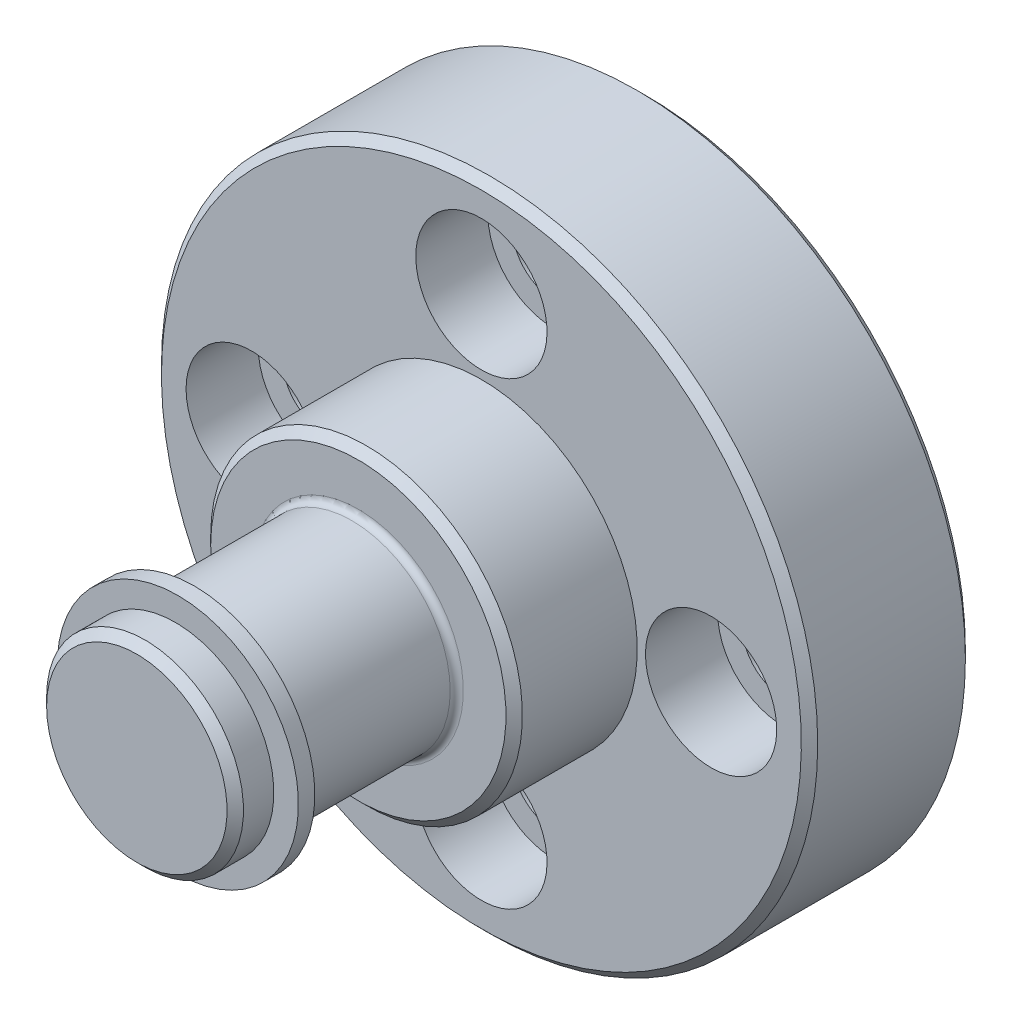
ISO-10303-21;
HEADER;
FILE_DESCRIPTION(('STEP AP214'),'2;1');
FILE_NAME('part.step','',(''),(''),'','','');
FILE_SCHEMA(('AUTOMOTIVE_DESIGN { 1 0 10303 214 1 1 1 1 }'));
ENDSEC;
DATA;
#1=APPLICATION_CONTEXT('core data for automotive mechanical design processes');
#2=APPLICATION_PROTOCOL_DEFINITION('international standard','automotive_design',2000,#1);
#3=PRODUCT_CONTEXT('',#1,'mechanical');
#4=PRODUCT('Part','Part','',(#3));
#5=PRODUCT_RELATED_PRODUCT_CATEGORY('part','',(#4));
#6=PRODUCT_DEFINITION_FORMATION('','',#4);
#7=PRODUCT_DEFINITION_CONTEXT('part definition',#1,'design');
#8=PRODUCT_DEFINITION('design','',#6,#7);
#9=PRODUCT_DEFINITION_SHAPE('','',#8);
#10=(LENGTH_UNIT() NAMED_UNIT(*) SI_UNIT(.MILLI.,.METRE.));
#11=(NAMED_UNIT(*) PLANE_ANGLE_UNIT() SI_UNIT($,.RADIAN.));
#12=(NAMED_UNIT(*) SI_UNIT($,.STERADIAN.) SOLID_ANGLE_UNIT());
#13=UNCERTAINTY_MEASURE_WITH_UNIT(LENGTH_MEASURE(1.E-05),#10,'distance_accuracy_value','');
#14=(GEOMETRIC_REPRESENTATION_CONTEXT(3) GLOBAL_UNCERTAINTY_ASSIGNED_CONTEXT((#13)) GLOBAL_UNIT_ASSIGNED_CONTEXT((#10,
#11,#12)) REPRESENTATION_CONTEXT('',''));
#15=CARTESIAN_POINT('',(0.,0.,0.));
#16=DIRECTION('',(0.,0.,1.));
#17=DIRECTION('',(1.,0.,0.));
#18=AXIS2_PLACEMENT_3D('',#15,#16,#17);
#19=CARTESIAN_POINT('',(8.434,-5.585152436,31.));
#20=DIRECTION('',(0.,0.,1.));
#21=DIRECTION('',(1.,0.,0.));
#22=AXIS2_PLACEMENT_3D('',#19,#20,#21);
#23=PLANE('',#22);
#24=CARTESIAN_POINT('',(14.,0.,31.));
#25=DIRECTION('',(0.,0.,-1.));
#26=DIRECTION('',(-1.,0.,0.));
#27=AXIS2_PLACEMENT_3D('',#24,#25,#26);
#28=CIRCLE('',#27,5.5);
#29=CARTESIAN_POINT('',(8.5,0.,31.));
#30=VERTEX_POINT('',#29);
#31=EDGE_CURVE('E16',#30,#30,#28,.T.);
#32=ORIENTED_EDGE('',*,*,#31,.F.);
#33=EDGE_LOOP('',(#32));
#34=FACE_BOUND('',#33,.T.);
#35=ADVANCED_FACE('F12',(#34),#23,.T.);
#36=CARTESIAN_POINT('',(14.,0.,31.));
#37=DIRECTION('',(0.,0.,-1.));
#38=DIRECTION('',(-1.,0.,0.));
#39=AXIS2_PLACEMENT_3D('',#36,#37,#38);
#40=CONICAL_SURFACE('',#39,5.5,0.785398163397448);
#41=ORIENTED_EDGE('',*,*,#31,.T.);
#42=EDGE_LOOP('',(#41));
#43=FACE_BOUND('',#42,.T.);
#44=CARTESIAN_POINT('',(14.,0.,30.5));
#45=DIRECTION('',(0.,0.,-1.));
#46=DIRECTION('',(-1.,0.,0.));
#47=AXIS2_PLACEMENT_3D('',#44,#45,#46);
#48=CIRCLE('',#47,6.);
#49=CARTESIAN_POINT('',(8.,0.,30.5));
#50=VERTEX_POINT('',#49);
#51=EDGE_CURVE('E28',#50,#50,#48,.T.);
#52=ORIENTED_EDGE('',*,*,#51,.F.);
#53=EDGE_LOOP('',(#52));
#54=FACE_BOUND('',#53,.T.);
#55=ADVANCED_FACE('F115',(#43,#54),#40,.T.);
#56=CARTESIAN_POINT('',(14.,0.,30.5));
#57=DIRECTION('',(0.,0.,-1.));
#58=DIRECTION('',(-1.,0.,0.));
#59=AXIS2_PLACEMENT_3D('',#56,#57,#58);
#60=CYLINDRICAL_SURFACE('',#59,6.);
#61=ORIENTED_EDGE('',*,*,#51,.T.);
#62=EDGE_LOOP('',(#61));
#63=FACE_BOUND('',#62,.T.);
#64=CARTESIAN_POINT('',(14.,0.,28.65));
#65=DIRECTION('',(0.,0.,-1.));
#66=DIRECTION('',(-1.,0.,0.));
#67=AXIS2_PLACEMENT_3D('',#64,#65,#66);
#68=CIRCLE('',#67,6.);
#69=CARTESIAN_POINT('',(8.,0.,28.65));
#70=VERTEX_POINT('',#69);
#71=EDGE_CURVE('E105',#70,#70,#68,.T.);
#72=ORIENTED_EDGE('',*,*,#71,.F.);
#73=EDGE_LOOP('',(#72));
#74=FACE_BOUND('',#73,.T.);
#75=ADVANCED_FACE('F125',(#63,#74),#60,.T.);
#76=CARTESIAN_POINT('',(20.072,-6.092893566,28.65));
#77=DIRECTION('',(0.,0.,-1.));
#78=DIRECTION('',(-1.,0.,0.));
#79=AXIS2_PLACEMENT_3D('',#76,#77,#78);
#80=PLANE('',#79);
#81=CARTESIAN_POINT('',(14.,0.,28.65));
#82=DIRECTION('',(0.,0.,-1.));
#83=DIRECTION('',(0.,1.,0.));
#84=AXIS2_PLACEMENT_3D('',#81,#82,#83);
#85=CIRCLE('',#84,5.75);
#86=CARTESIAN_POINT('',(14.,5.75,28.65));
#87=VERTEX_POINT('',#86);
#88=EDGE_CURVE('E103',#87,#87,#85,.T.);
#89=ORIENTED_EDGE('',*,*,#88,.F.);
#90=EDGE_LOOP('',(#89));
#91=FACE_BOUND('',#90,.T.);
#92=ORIENTED_EDGE('',*,*,#71,.T.);
#93=EDGE_LOOP('',(#92));
#94=FACE_BOUND('',#93,.T.);
#95=ADVANCED_FACE('F207',(#91,#94),#80,.T.);
#96=CARTESIAN_POINT('',(14.,0.,28.65));
#97=DIRECTION('',(0.,0.,-1.));
#98=DIRECTION('',(0.,1.,0.));
#99=AXIS2_PLACEMENT_3D('',#96,#97,#98);
#100=CYLINDRICAL_SURFACE('',#99,5.75);
#101=ORIENTED_EDGE('',*,*,#88,.T.);
#102=EDGE_LOOP('',(#101));
#103=FACE_BOUND('',#102,.T.);
#104=CARTESIAN_POINT('',(14.,0.,28.5));
#105=DIRECTION('',(0.,0.,-1.));
#106=DIRECTION('',(0.,1.,0.));
#107=AXIS2_PLACEMENT_3D('',#104,#105,#106);
#108=CIRCLE('',#107,5.75);
#109=CARTESIAN_POINT('',(14.,5.75,28.5));
#110=VERTEX_POINT('',#109);
#111=EDGE_CURVE('E100',#110,#110,#108,.T.);
#112=ORIENTED_EDGE('',*,*,#111,.F.);
#113=EDGE_LOOP('',(#112));
#114=FACE_BOUND('',#113,.T.);
#115=ADVANCED_FACE('F204',(#103,#114),#100,.T.);
#116=CARTESIAN_POINT('',(6.5618,-7.463794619,28.5));
#117=DIRECTION('',(0.,0.,1.));
#118=DIRECTION('',(1.,0.,0.));
#119=AXIS2_PLACEMENT_3D('',#116,#117,#118);
#120=PLANE('',#119);
#121=ORIENTED_EDGE('',*,*,#111,.T.);
#122=EDGE_LOOP('',(#121));
#123=FACE_BOUND('',#122,.T.);
#124=CARTESIAN_POINT('',(14.,0.,28.5));
#125=DIRECTION('',(0.,0.,-1.));
#126=DIRECTION('',(0.,1.,0.));
#127=AXIS2_PLACEMENT_3D('',#124,#125,#126);
#128=CIRCLE('',#127,7.35);
#129=CARTESIAN_POINT('',(14.,7.35,28.5));
#130=VERTEX_POINT('',#129);
#131=EDGE_CURVE('E97',#130,#130,#128,.T.);
#132=ORIENTED_EDGE('',*,*,#131,.F.);
#133=EDGE_LOOP('',(#132));
#134=FACE_BOUND('',#133,.T.);
#135=ADVANCED_FACE('F202',(#123,#134),#120,.T.);
#136=CARTESIAN_POINT('',(14.,0.,28.5));
#137=DIRECTION('',(0.,0.,-1.));
#138=DIRECTION('',(0.,1.,0.));
#139=AXIS2_PLACEMENT_3D('',#136,#137,#138);
#140=CYLINDRICAL_SURFACE('',#139,7.35);
#141=ORIENTED_EDGE('',*,*,#131,.T.);
#142=EDGE_LOOP('',(#141));
#143=FACE_BOUND('',#142,.T.);
#144=CARTESIAN_POINT('',(14.,0.,27.5));
#145=DIRECTION('',(0.,0.,-1.));
#146=DIRECTION('',(0.,1.,0.));
#147=AXIS2_PLACEMENT_3D('',#144,#145,#146);
#148=CIRCLE('',#147,7.35);
#149=CARTESIAN_POINT('',(14.,7.35,27.5));
#150=VERTEX_POINT('',#149);
#151=EDGE_CURVE('E94',#150,#150,#148,.T.);
#152=ORIENTED_EDGE('',*,*,#151,.F.);
#153=EDGE_LOOP('',(#152));
#154=FACE_BOUND('',#153,.T.);
#155=ADVANCED_FACE('F199',(#143,#154),#140,.T.);
#156=CARTESIAN_POINT('',(21.4382,-7.463794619,27.5));
#157=DIRECTION('',(0.,0.,-1.));
#158=DIRECTION('',(-1.,0.,0.));
#159=AXIS2_PLACEMENT_3D('',#156,#157,#158);
#160=PLANE('',#159);
#161=CARTESIAN_POINT('',(14.,0.,27.5));
#162=DIRECTION('',(0.,0.,-1.));
#163=DIRECTION('',(-1.,0.,0.));
#164=AXIS2_PLACEMENT_3D('',#161,#162,#163);
#165=CIRCLE('',#164,6.);
#166=CARTESIAN_POINT('',(8.,0.,27.5));
#167=VERTEX_POINT('',#166);
#168=EDGE_CURVE('E91',#167,#167,#165,.T.);
#169=ORIENTED_EDGE('',*,*,#168,.F.);
#170=EDGE_LOOP('',(#169));
#171=FACE_BOUND('',#170,.T.);
#172=ORIENTED_EDGE('',*,*,#151,.T.);
#173=EDGE_LOOP('',(#172));
#174=FACE_BOUND('',#173,.T.);
#175=ADVANCED_FACE('F197',(#171,#174),#160,.T.);
#176=CARTESIAN_POINT('',(14.,0.,27.5));
#177=DIRECTION('',(0.,0.,-1.));
#178=DIRECTION('',(-1.,0.,0.));
#179=AXIS2_PLACEMENT_3D('',#176,#177,#178);
#180=CYLINDRICAL_SURFACE('',#179,6.);
#181=ORIENTED_EDGE('',*,*,#168,.T.);
#182=EDGE_LOOP('',(#181));
#183=FACE_BOUND('',#182,.T.);
#184=CARTESIAN_POINT('',(14.,0.,17.9));
#185=DIRECTION('',(0.,0.,1.));
#186=DIRECTION('',(1.,0.,0.));
#187=AXIS2_PLACEMENT_3D('',#184,#185,#186);
#188=CIRCLE('',#187,6.);
#189=CARTESIAN_POINT('',(20.,0.,17.9));
#190=VERTEX_POINT('',#189);
#191=EDGE_CURVE('E90',#190,#190,#188,.T.);
#192=ORIENTED_EDGE('',*,*,#191,.T.);
#193=EDGE_LOOP('',(#192));
#194=FACE_BOUND('',#193,.T.);
#195=ADVANCED_FACE('F194',(#183,#194),#180,.T.);
#196=CARTESIAN_POINT('',(14.,0.,17.9));
#197=DIRECTION('',(0.,0.,-1.));
#198=DIRECTION('',(-1.,0.,0.));
#199=AXIS2_PLACEMENT_3D('',#196,#197,#198);
#200=TOROIDAL_SURFACE('',#199,6.4,0.4);
#201=ORIENTED_EDGE('',*,*,#191,.F.);
#202=EDGE_LOOP('',(#201));
#203=FACE_BOUND('',#202,.T.);
#204=CARTESIAN_POINT('',(14.,0.,17.5));
#205=DIRECTION('',(0.,0.,-1.));
#206=DIRECTION('',(-1.,0.,0.));
#207=AXIS2_PLACEMENT_3D('',#204,#205,#206);
#208=CIRCLE('',#207,6.400000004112);
#209=CARTESIAN_POINT('',(7.599999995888,0.,17.5));
#210=VERTEX_POINT('',#209);
#211=EDGE_CURVE('E87',#210,#210,#208,.T.);
#212=ORIENTED_EDGE('',*,*,#211,.F.);
#213=EDGE_LOOP('',(#212));
#214=FACE_BOUND('',#213,.T.);
#215=ADVANCED_FACE('F192',(#203,#214),#200,.F.);
#216=CARTESIAN_POINT('',(14.,0.,0.));
#217=DIRECTION('',(0.,0.,1.));
#218=DIRECTION('',(1.,0.,0.));
#219=AXIS2_PLACEMENT_3D('',#216,#217,#218);
#220=CONICAL_SURFACE('',#219,19.5,0.785398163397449);
#221=CARTESIAN_POINT('',(14.,0.,0.));
#222=DIRECTION('',(0.,0.,1.));
#223=DIRECTION('',(1.,0.,0.));
#224=AXIS2_PLACEMENT_3D('',#221,#222,#223);
#225=CIRCLE('',#224,19.5);
#226=CARTESIAN_POINT('',(33.5,0.,0.));
#227=VERTEX_POINT('',#226);
#228=EDGE_CURVE('E84',#227,#227,#225,.F.);
#229=ORIENTED_EDGE('',*,*,#228,.F.);
#230=EDGE_LOOP('',(#229));
#231=FACE_BOUND('',#230,.T.);
#232=CARTESIAN_POINT('',(14.,0.,0.5));
#233=DIRECTION('',(0.,0.,-1.));
#234=DIRECTION('',(-1.,0.,0.));
#235=AXIS2_PLACEMENT_3D('',#232,#233,#234);
#236=CIRCLE('',#235,20.);
#237=CARTESIAN_POINT('',(-6.,0.,0.500000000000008));
#238=VERTEX_POINT('',#237);
#239=EDGE_CURVE('E74',#238,#238,#236,.F.);
#240=ORIENTED_EDGE('',*,*,#239,.F.);
#241=EDGE_LOOP('',(#240));
#242=FACE_BOUND('',#241,.T.);
#243=ADVANCED_FACE('F188',(#231,#242),#220,.T.);
#244=CARTESIAN_POINT('',(14.,-14.,5.6));
#245=DIRECTION('',(0.,0.,-1.));
#246=DIRECTION('',(-1.,0.,0.));
#247=AXIS2_PLACEMENT_3D('',#244,#245,#246);
#248=CYLINDRICAL_SURFACE('',#247,2.5);
#249=CARTESIAN_POINT('',(14.,-14.,5.6));
#250=DIRECTION('',(0.,0.,-1.));
#251=DIRECTION('',(-1.,0.,0.));
#252=AXIS2_PLACEMENT_3D('',#249,#250,#251);
#253=CIRCLE('',#252,2.5);
#254=CARTESIAN_POINT('',(11.5,-14.,5.6));
#255=VERTEX_POINT('',#254);
#256=EDGE_CURVE('E71',#255,#255,#253,.F.);
#257=ORIENTED_EDGE('',*,*,#256,.T.);
#258=EDGE_LOOP('',(#257));
#259=FACE_BOUND('',#258,.T.);
#260=CARTESIAN_POINT('',(14.,-14.,0.));
#261=DIRECTION('',(0.,0.,-1.));
#262=DIRECTION('',(-1.,0.,0.));
#263=AXIS2_PLACEMENT_3D('',#260,#261,#262);
#264=CIRCLE('',#263,2.5);
#265=CARTESIAN_POINT('',(11.5,-14.,0.));
#266=VERTEX_POINT('',#265);
#267=EDGE_CURVE('E81',#266,#266,#264,.F.);
#268=ORIENTED_EDGE('',*,*,#267,.F.);
#269=EDGE_LOOP('',(#268));
#270=FACE_BOUND('',#269,.T.);
#271=ADVANCED_FACE('F184',(#259,#270),#248,.F.);
#272=CARTESIAN_POINT('',(28.,0.,5.6));
#273=DIRECTION('',(0.,0.,-1.));
#274=DIRECTION('',(-1.,0.,0.));
#275=AXIS2_PLACEMENT_3D('',#272,#273,#274);
#276=CYLINDRICAL_SURFACE('',#275,2.5);
#277=CARTESIAN_POINT('',(28.,0.,5.6));
#278=DIRECTION('',(0.,0.,-1.));
#279=DIRECTION('',(-1.,0.,0.));
#280=AXIS2_PLACEMENT_3D('',#277,#278,#279);
#281=CIRCLE('',#280,2.5);
#282=CARTESIAN_POINT('',(25.5,0.,5.6));
#283=VERTEX_POINT('',#282);
#284=EDGE_CURVE('E68',#283,#283,#281,.F.);
#285=ORIENTED_EDGE('',*,*,#284,.T.);
#286=EDGE_LOOP('',(#285));
#287=FACE_BOUND('',#286,.T.);
#288=CARTESIAN_POINT('',(28.,0.,0.));
#289=DIRECTION('',(0.,0.,-1.));
#290=DIRECTION('',(-1.,0.,0.));
#291=AXIS2_PLACEMENT_3D('',#288,#289,#290);
#292=CIRCLE('',#291,2.5);
#293=CARTESIAN_POINT('',(25.5,0.,0.));
#294=VERTEX_POINT('',#293);
#295=EDGE_CURVE('E78',#294,#294,#292,.F.);
#296=ORIENTED_EDGE('',*,*,#295,.F.);
#297=EDGE_LOOP('',(#296));
#298=FACE_BOUND('',#297,.T.);
#299=ADVANCED_FACE('F180',(#287,#298),#276,.F.);
#300=CARTESIAN_POINT('',(14.,14.,5.6));
#301=DIRECTION('',(0.,0.,-1.));
#302=DIRECTION('',(-1.,0.,0.));
#303=AXIS2_PLACEMENT_3D('',#300,#301,#302);
#304=CYLINDRICAL_SURFACE('',#303,2.5);
#305=CARTESIAN_POINT('',(14.,14.,5.6));
#306=DIRECTION('',(0.,0.,-1.));
#307=DIRECTION('',(-1.,0.,0.));
#308=AXIS2_PLACEMENT_3D('',#305,#306,#307);
#309=CIRCLE('',#308,2.5);
#310=CARTESIAN_POINT('',(11.5,14.,5.6));
#311=VERTEX_POINT('',#310);
#312=EDGE_CURVE('E65',#311,#311,#309,.F.);
#313=ORIENTED_EDGE('',*,*,#312,.T.);
#314=EDGE_LOOP('',(#313));
#315=FACE_BOUND('',#314,.T.);
#316=CARTESIAN_POINT('',(14.,14.,0.));
#317=DIRECTION('',(0.,0.,-1.));
#318=DIRECTION('',(-1.,0.,0.));
#319=AXIS2_PLACEMENT_3D('',#316,#317,#318);
#320=CIRCLE('',#319,2.5);
#321=CARTESIAN_POINT('',(11.5,14.,0.));
#322=VERTEX_POINT('',#321);
#323=EDGE_CURVE('E75',#322,#322,#320,.F.);
#324=ORIENTED_EDGE('',*,*,#323,.F.);
#325=EDGE_LOOP('',(#324));
#326=FACE_BOUND('',#325,.T.);
#327=ADVANCED_FACE('F176',(#315,#326),#304,.F.);
#328=CARTESIAN_POINT('',(4.892,-9.139340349,17.5));
#329=DIRECTION('',(0.,0.,1.));
#330=DIRECTION('',(1.,0.,0.));
#331=AXIS2_PLACEMENT_3D('',#328,#329,#330);
#332=PLANE('',#331);
#333=ORIENTED_EDGE('',*,*,#211,.T.);
#334=EDGE_LOOP('',(#333));
#335=FACE_BOUND('',#334,.T.);
#336=CARTESIAN_POINT('',(14.,0.,17.5));
#337=DIRECTION('',(0.,0.,-1.));
#338=DIRECTION('',(-1.,0.,0.));
#339=AXIS2_PLACEMENT_3D('',#336,#337,#338);
#340=CIRCLE('',#339,9.);
#341=CARTESIAN_POINT('',(5.,0.,17.5));
#342=VERTEX_POINT('',#341);
#343=EDGE_CURVE('E62',#342,#342,#340,.T.);
#344=ORIENTED_EDGE('',*,*,#343,.F.);
#345=EDGE_LOOP('',(#344));
#346=FACE_BOUND('',#345,.T.);
#347=ADVANCED_FACE('F179',(#335,#346),#332,.T.);
#348=CARTESIAN_POINT('',(33.734,-19.80190409,0.));
#349=DIRECTION('',(0.,0.,-1.));
#350=DIRECTION('',(-1.,0.,0.));
#351=AXIS2_PLACEMENT_3D('',#348,#349,#350);
#352=PLANE('',#351);
#353=ORIENTED_EDGE('',*,*,#323,.T.);
#354=EDGE_LOOP('',(#353));
#355=FACE_BOUND('',#354,.T.);
#356=ORIENTED_EDGE('',*,*,#295,.T.);
#357=EDGE_LOOP('',(#356));
#358=FACE_BOUND('',#357,.T.);
#359=ORIENTED_EDGE('',*,*,#267,.T.);
#360=EDGE_LOOP('',(#359));
#361=FACE_BOUND('',#360,.T.);
#362=CARTESIAN_POINT('',(0.,0.,0.));
#363=DIRECTION('',(0.,0.,-1.));
#364=DIRECTION('',(-1.,0.,0.));
#365=AXIS2_PLACEMENT_3D('',#362,#363,#364);
#366=CIRCLE('',#365,2.5);
#367=CARTESIAN_POINT('',(-2.5,0.,0.));
#368=VERTEX_POINT('',#367);
#369=EDGE_CURVE('E59',#368,#368,#366,.F.);
#370=ORIENTED_EDGE('',*,*,#369,.T.);
#371=EDGE_LOOP('',(#370));
#372=FACE_BOUND('',#371,.T.);
#373=ORIENTED_EDGE('',*,*,#228,.T.);
#374=EDGE_LOOP('',(#373));
#375=FACE_BOUND('',#374,.T.);
#376=ADVANCED_FACE('F174',(#355,#358,#361,#372,#375),#352,.T.);
#377=CARTESIAN_POINT('',(14.,0.,9.5));
#378=DIRECTION('',(0.,0.,-1.));
#379=DIRECTION('',(-1.,0.,0.));
#380=AXIS2_PLACEMENT_3D('',#377,#378,#379);
#381=CYLINDRICAL_SURFACE('',#380,20.);
#382=CARTESIAN_POINT('',(14.,0.,9.5));
#383=DIRECTION('',(0.,0.,-1.));
#384=DIRECTION('',(-1.,0.,0.));
#385=AXIS2_PLACEMENT_3D('',#382,#383,#384);
#386=CIRCLE('',#385,20.);
#387=CARTESIAN_POINT('',(-6.,0.,9.49999999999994));
#388=VERTEX_POINT('',#387);
#389=EDGE_CURVE('E58',#388,#388,#386,.F.);
#390=ORIENTED_EDGE('',*,*,#389,.F.);
#391=EDGE_LOOP('',(#390));
#392=FACE_BOUND('',#391,.T.);
#393=ORIENTED_EDGE('',*,*,#239,.T.);
#394=EDGE_LOOP('',(#393));
#395=FACE_BOUND('',#394,.T.);
#396=ADVANCED_FACE('F170',(#392,#395),#381,.T.);
#397=CARTESIAN_POINT('',(9.952,-9.938070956,5.6));
#398=DIRECTION('',(0.,0.,-1.));
#399=DIRECTION('',(1.,0.,0.));
#400=AXIS2_PLACEMENT_3D('',#397,#398,#399);
#401=PLANE('',#400);
#402=ORIENTED_EDGE('',*,*,#256,.F.);
#403=EDGE_LOOP('',(#402));
#404=FACE_BOUND('',#403,.T.);
#405=CARTESIAN_POINT('',(14.,-14.,5.6));
#406=DIRECTION('',(0.,0.,-1.));
#407=DIRECTION('',(0.,1.,0.));
#408=AXIS2_PLACEMENT_3D('',#405,#406,#407);
#409=CIRCLE('',#408,4.);
#410=CARTESIAN_POINT('',(14.,-10.,5.6));
#411=VERTEX_POINT('',#410);
#412=EDGE_CURVE('E55',#411,#411,#409,.F.);
#413=ORIENTED_EDGE('',*,*,#412,.T.);
#414=EDGE_LOOP('',(#413));
#415=FACE_BOUND('',#414,.T.);
#416=ADVANCED_FACE('F173',(#404,#415),#401,.F.);
#417=CARTESIAN_POINT('',(23.938070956,-4.048,5.6));
#418=DIRECTION('',(0.,0.,-1.));
#419=DIRECTION('',(0.,1.,0.));
#420=AXIS2_PLACEMENT_3D('',#417,#418,#419);
#421=PLANE('',#420);
#422=ORIENTED_EDGE('',*,*,#284,.F.);
#423=EDGE_LOOP('',(#422));
#424=FACE_BOUND('',#423,.T.);
#425=CARTESIAN_POINT('',(28.,0.,5.6));
#426=DIRECTION('',(0.,0.,-1.));
#427=DIRECTION('',(-1.,0.,0.));
#428=AXIS2_PLACEMENT_3D('',#425,#426,#427);
#429=CIRCLE('',#428,4.);
#430=CARTESIAN_POINT('',(24.,0.,5.6));
#431=VERTEX_POINT('',#430);
#432=EDGE_CURVE('E52',#431,#431,#429,.F.);
#433=ORIENTED_EDGE('',*,*,#432,.T.);
#434=EDGE_LOOP('',(#433));
#435=FACE_BOUND('',#434,.T.);
#436=ADVANCED_FACE('F238',(#424,#435),#421,.F.);
#437=CARTESIAN_POINT('',(18.048,9.938070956,5.6));
#438=DIRECTION('',(0.,0.,-1.));
#439=DIRECTION('',(-1.,0.,0.));
#440=AXIS2_PLACEMENT_3D('',#437,#438,#439);
#441=PLANE('',#440);
#442=ORIENTED_EDGE('',*,*,#312,.F.);
#443=EDGE_LOOP('',(#442));
#444=FACE_BOUND('',#443,.T.);
#445=CARTESIAN_POINT('',(14.,14.,5.6));
#446=DIRECTION('',(0.,0.,-1.));
#447=DIRECTION('',(0.,1.,0.));
#448=AXIS2_PLACEMENT_3D('',#445,#446,#447);
#449=CIRCLE('',#448,4.);
#450=CARTESIAN_POINT('',(14.,18.,5.6));
#451=VERTEX_POINT('',#450);
#452=EDGE_CURVE('E49',#451,#451,#449,.F.);
#453=ORIENTED_EDGE('',*,*,#452,.T.);
#454=EDGE_LOOP('',(#453));
#455=FACE_BOUND('',#454,.T.);
#456=ADVANCED_FACE('F168',(#444,#455),#441,.F.);
#457=CARTESIAN_POINT('',(14.,0.,17.5));
#458=DIRECTION('',(0.,0.,-1.));
#459=DIRECTION('',(-1.,0.,0.));
#460=AXIS2_PLACEMENT_3D('',#457,#458,#459);
#461=CONICAL_SURFACE('',#460,9.,0.785398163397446);
#462=ORIENTED_EDGE('',*,*,#343,.T.);
#463=EDGE_LOOP('',(#462));
#464=FACE_BOUND('',#463,.T.);
#465=CARTESIAN_POINT('',(14.,0.,17.));
#466=DIRECTION('',(0.,0.,-1.));
#467=DIRECTION('',(-1.,0.,0.));
#468=AXIS2_PLACEMENT_3D('',#465,#466,#467);
#469=CIRCLE('',#468,9.5);
#470=CARTESIAN_POINT('',(4.5,0.,17.));
#471=VERTEX_POINT('',#470);
#472=EDGE_CURVE('E48',#471,#471,#469,.T.);
#473=ORIENTED_EDGE('',*,*,#472,.F.);
#474=EDGE_LOOP('',(#473));
#475=FACE_BOUND('',#474,.T.);
#476=ADVANCED_FACE('F164',(#464,#475),#461,.T.);
#477=CARTESIAN_POINT('',(0.,0.,5.6));
#478=DIRECTION('',(0.,0.,-1.));
#479=DIRECTION('',(-1.,0.,0.));
#480=AXIS2_PLACEMENT_3D('',#477,#478,#479);
#481=CYLINDRICAL_SURFACE('',#480,2.5);
#482=CARTESIAN_POINT('',(0.,0.,5.6));
#483=DIRECTION('',(0.,0.,-1.));
#484=DIRECTION('',(-1.,0.,0.));
#485=AXIS2_PLACEMENT_3D('',#482,#483,#484);
#486=CIRCLE('',#485,2.5);
#487=CARTESIAN_POINT('',(-2.5,0.,5.6));
#488=VERTEX_POINT('',#487);
#489=EDGE_CURVE('E45',#488,#488,#486,.F.);
#490=ORIENTED_EDGE('',*,*,#489,.T.);
#491=EDGE_LOOP('',(#490));
#492=FACE_BOUND('',#491,.T.);
#493=ORIENTED_EDGE('',*,*,#369,.F.);
#494=EDGE_LOOP('',(#493));
#495=FACE_BOUND('',#494,.T.);
#496=ADVANCED_FACE('F160',(#492,#495),#481,.F.);
#497=CARTESIAN_POINT('',(14.,0.,10.));
#498=DIRECTION('',(0.,0.,-1.));
#499=DIRECTION('',(0.,1.,0.));
#500=AXIS2_PLACEMENT_3D('',#497,#498,#499);
#501=CONICAL_SURFACE('',#500,19.5,0.785398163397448);
#502=CARTESIAN_POINT('',(14.,0.,10.));
#503=DIRECTION('',(0.,0.,-1.));
#504=DIRECTION('',(0.,1.,0.));
#505=AXIS2_PLACEMENT_3D('',#502,#503,#504);
#506=CIRCLE('',#505,19.5);
#507=CARTESIAN_POINT('',(14.,19.5,10.));
#508=VERTEX_POINT('',#507);
#509=EDGE_CURVE('E42',#508,#508,#506,.F.);
#510=ORIENTED_EDGE('',*,*,#509,.F.);
#511=EDGE_LOOP('',(#510));
#512=FACE_BOUND('',#511,.T.);
#513=ORIENTED_EDGE('',*,*,#389,.T.);
#514=EDGE_LOOP('',(#513));
#515=FACE_BOUND('',#514,.T.);
#516=ADVANCED_FACE('F156',(#512,#515),#501,.T.);
#517=CARTESIAN_POINT('',(14.,-14.,10.));
#518=DIRECTION('',(0.,0.,-1.));
#519=DIRECTION('',(0.,1.,0.));
#520=AXIS2_PLACEMENT_3D('',#517,#518,#519);
#521=CYLINDRICAL_SURFACE('',#520,4.);
#522=ORIENTED_EDGE('',*,*,#412,.F.);
#523=EDGE_LOOP('',(#522));
#524=FACE_BOUND('',#523,.T.);
#525=CARTESIAN_POINT('',(14.,-14.,10.));
#526=DIRECTION('',(0.,0.,-1.));
#527=DIRECTION('',(0.,1.,0.));
#528=AXIS2_PLACEMENT_3D('',#525,#526,#527);
#529=CIRCLE('',#528,4.);
#530=CARTESIAN_POINT('',(14.,-10.,10.));
#531=VERTEX_POINT('',#530);
#532=EDGE_CURVE('E39',#531,#531,#529,.T.);
#533=ORIENTED_EDGE('',*,*,#532,.F.);
#534=EDGE_LOOP('',(#533));
#535=FACE_BOUND('',#534,.T.);
#536=ADVANCED_FACE('F152',(#524,#535),#521,.F.);
#537=CARTESIAN_POINT('',(28.,0.,10.));
#538=DIRECTION('',(0.,0.,-1.));
#539=DIRECTION('',(-1.,0.,0.));
#540=AXIS2_PLACEMENT_3D('',#537,#538,#539);
#541=CYLINDRICAL_SURFACE('',#540,4.);
#542=ORIENTED_EDGE('',*,*,#432,.F.);
#543=EDGE_LOOP('',(#542));
#544=FACE_BOUND('',#543,.T.);
#545=CARTESIAN_POINT('',(28.,0.,10.));
#546=DIRECTION('',(0.,0.,-1.));
#547=DIRECTION('',(-1.,0.,0.));
#548=AXIS2_PLACEMENT_3D('',#545,#546,#547);
#549=CIRCLE('',#548,4.);
#550=CARTESIAN_POINT('',(24.,0.,10.));
#551=VERTEX_POINT('',#550);
#552=EDGE_CURVE('E36',#551,#551,#549,.T.);
#553=ORIENTED_EDGE('',*,*,#552,.F.);
#554=EDGE_LOOP('',(#553));
#555=FACE_BOUND('',#554,.T.);
#556=ADVANCED_FACE('F148',(#544,#555),#541,.F.);
#557=CARTESIAN_POINT('',(14.,14.,10.));
#558=DIRECTION('',(0.,0.,-1.));
#559=DIRECTION('',(0.,1.,0.));
#560=AXIS2_PLACEMENT_3D('',#557,#558,#559);
#561=CYLINDRICAL_SURFACE('',#560,4.);
#562=ORIENTED_EDGE('',*,*,#452,.F.);
#563=EDGE_LOOP('',(#562));
#564=FACE_BOUND('',#563,.T.);
#565=CARTESIAN_POINT('',(14.,14.,10.));
#566=DIRECTION('',(0.,0.,-1.));
#567=DIRECTION('',(0.,1.,0.));
#568=AXIS2_PLACEMENT_3D('',#565,#566,#567);
#569=CIRCLE('',#568,4.);
#570=CARTESIAN_POINT('',(14.,18.,10.));
#571=VERTEX_POINT('',#570);
#572=EDGE_CURVE('E33',#571,#571,#569,.T.);
#573=ORIENTED_EDGE('',*,*,#572,.F.);
#574=EDGE_LOOP('',(#573));
#575=FACE_BOUND('',#574,.T.);
#576=ADVANCED_FACE('F144',(#564,#575),#561,.F.);
#577=CARTESIAN_POINT('',(14.,0.,17.));
#578=DIRECTION('',(0.,0.,-1.));
#579=DIRECTION('',(-1.,0.,0.));
#580=AXIS2_PLACEMENT_3D('',#577,#578,#579);
#581=CYLINDRICAL_SURFACE('',#580,9.5);
#582=ORIENTED_EDGE('',*,*,#472,.T.);
#583=EDGE_LOOP('',(#582));
#584=FACE_BOUND('',#583,.T.);
#585=CARTESIAN_POINT('',(14.,0.,10.));
#586=DIRECTION('',(0.,0.,-1.));
#587=DIRECTION('',(-1.,0.,0.));
#588=AXIS2_PLACEMENT_3D('',#585,#586,#587);
#589=CIRCLE('',#588,9.5);
#590=CARTESIAN_POINT('',(4.5,0.,10.));
#591=VERTEX_POINT('',#590);
#592=EDGE_CURVE('E25',#591,#591,#589,.T.);
#593=ORIENTED_EDGE('',*,*,#592,.F.);
#594=EDGE_LOOP('',(#593));
#595=FACE_BOUND('',#594,.T.);
#596=ADVANCED_FACE('F141',(#584,#595),#581,.T.);
#597=CARTESIAN_POINT('',(4.061929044,4.048,5.6));
#598=DIRECTION('',(0.,0.,-1.));
#599=DIRECTION('',(0.,-1.,0.));
#600=AXIS2_PLACEMENT_3D('',#597,#598,#599);
#601=PLANE('',#600);
#602=ORIENTED_EDGE('',*,*,#489,.F.);
#603=EDGE_LOOP('',(#602));
#604=FACE_BOUND('',#603,.T.);
#605=CARTESIAN_POINT('',(0.,0.,5.6));
#606=DIRECTION('',(0.,0.,-1.));
#607=DIRECTION('',(-1.,0.,0.));
#608=AXIS2_PLACEMENT_3D('',#605,#606,#607);
#609=CIRCLE('',#608,4.);
#610=CARTESIAN_POINT('',(-4.,0.,5.6));
#611=VERTEX_POINT('',#610);
#612=EDGE_CURVE('E20',#611,#611,#609,.F.);
#613=ORIENTED_EDGE('',*,*,#612,.T.);
#614=EDGE_LOOP('',(#613));
#615=FACE_BOUND('',#614,.T.);
#616=ADVANCED_FACE('F136',(#604,#615),#601,.F.);
#617=CARTESIAN_POINT('',(-5.734,-19.80190409,10.));
#618=DIRECTION('',(0.,0.,1.));
#619=DIRECTION('',(1.,0.,0.));
#620=AXIS2_PLACEMENT_3D('',#617,#618,#619);
#621=PLANE('',#620);
#622=ORIENTED_EDGE('',*,*,#592,.T.);
#623=EDGE_LOOP('',(#622));
#624=FACE_BOUND('',#623,.T.);
#625=ORIENTED_EDGE('',*,*,#572,.T.);
#626=EDGE_LOOP('',(#625));
#627=FACE_BOUND('',#626,.T.);
#628=ORIENTED_EDGE('',*,*,#552,.T.);
#629=EDGE_LOOP('',(#628));
#630=FACE_BOUND('',#629,.T.);
#631=ORIENTED_EDGE('',*,*,#532,.T.);
#632=EDGE_LOOP('',(#631));
#633=FACE_BOUND('',#632,.T.);
#634=CARTESIAN_POINT('',(0.,0.,10.));
#635=DIRECTION('',(0.,0.,-1.));
#636=DIRECTION('',(-1.,0.,0.));
#637=AXIS2_PLACEMENT_3D('',#634,#635,#636);
#638=CIRCLE('',#637,4.);
#639=CARTESIAN_POINT('',(-4.,0.,10.));
#640=VERTEX_POINT('',#639);
#641=EDGE_CURVE('E8',#640,#640,#638,.T.);
#642=ORIENTED_EDGE('',*,*,#641,.T.);
#643=EDGE_LOOP('',(#642));
#644=FACE_BOUND('',#643,.T.);
#645=ORIENTED_EDGE('',*,*,#509,.T.);
#646=EDGE_LOOP('',(#645));
#647=FACE_BOUND('',#646,.T.);
#648=ADVANCED_FACE('F14',(#624,#627,#630,#633,#644,#647),#621,.T.);
#649=CARTESIAN_POINT('',(0.,0.,10.));
#650=DIRECTION('',(0.,0.,-1.));
#651=DIRECTION('',(-1.,0.,0.));
#652=AXIS2_PLACEMENT_3D('',#649,#650,#651);
#653=CYLINDRICAL_SURFACE('',#652,4.);
#654=ORIENTED_EDGE('',*,*,#612,.F.);
#655=EDGE_LOOP('',(#654));
#656=FACE_BOUND('',#655,.T.);
#657=ORIENTED_EDGE('',*,*,#641,.F.);
#658=EDGE_LOOP('',(#657));
#659=FACE_BOUND('',#658,.T.);
#660=ADVANCED_FACE('F129',(#656,#659),#653,.F.);
#661=CLOSED_SHELL('',(#35,#55,#75,#95,#115,#135,#155,#175,#195,#215,#243,#271,#299,#327,#347,
#376,#396,#416,#436,#456,#476,#496,#516,#536,#556,#576,#596,#616,#648,#660));
#662=MANIFOLD_SOLID_BREP('B1',#661);
#663=ADVANCED_BREP_SHAPE_REPRESENTATION('',(#18,#662),#14);
#664=SHAPE_DEFINITION_REPRESENTATION(#9,#663);
ENDSEC;
END-ISO-10303-21;
